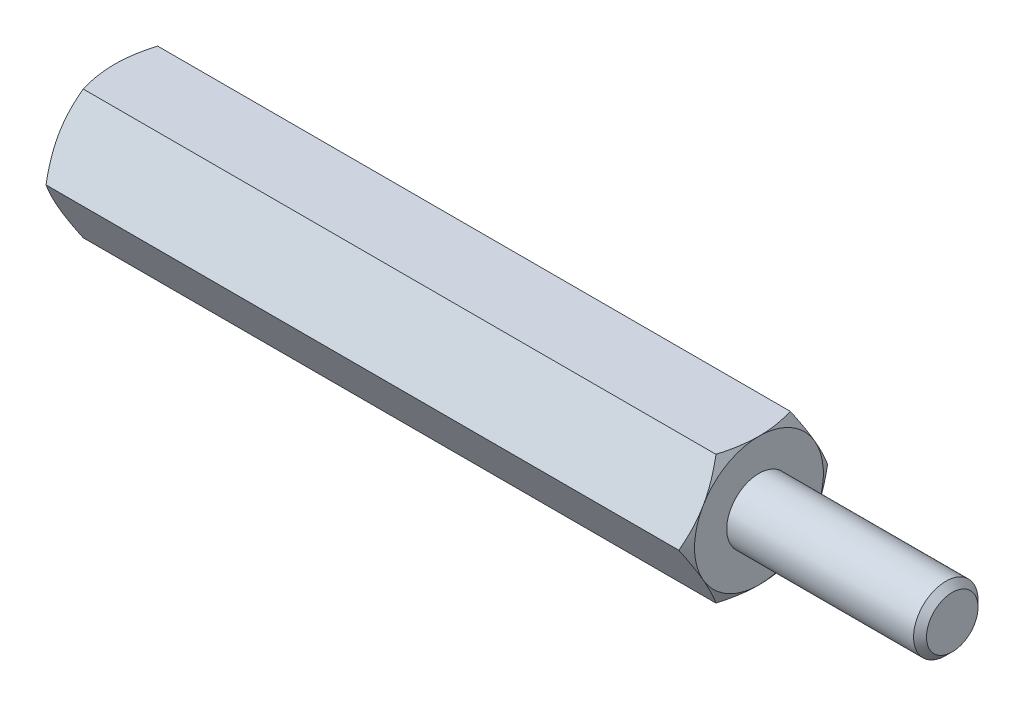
from build123d import *

# Parameters (mm, degrees)
EXTRUDE2_DEPTH = 10
SKETCH3_R      = 0.8
EXTRUDE3_DEPTH = 6
SKETCH5_R      = 1
EXTRUDE4_DEPTH = 6
CHAMFER1_SIZE  = 0.2


with BuildPart() as part:
    # Sketch1 → Extrude2 (new, symmetric)
    with BuildSketch(Plane(origin=(0, 0, 0), x_dir=(0, 0, -1), z_dir=(1, 0, 0))):
        Polygon((1.154700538, 2), (-1.154700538, 2), (-2.309401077, 0), (-1.154700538, -2), (1.154700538, -2), (2.309401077, 0), align=None)
    extrude(amount=EXTRUDE2_DEPTH, both=True)

    # Sketch2 → Cut-Revolve1 (revolve, cut)
    with BuildSketch(Plane.XY):
        with BuildLine():
            Line((-10, 2), (-8.5, 4.598076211))
            ThreePointArc((-8.5, 4.598076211), (-8.98810136, 5.776457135), (-10, 5))
            Line((-10, 5), (-10, 2))
        make_face()
    cut_revolve1 = revolve(axis=Axis((0, 0, 0), (1, 0, 0)), mode=Mode.SUBTRACT)

    # Mirror1: Cut-Revolve1 across plane
    add(cut_revolve1.mirror(Plane(origin=(0, 0, 0), x_dir=(0, 0, 1), z_dir=(1, 0, 0))), mode=Mode.SUBTRACT)

    # Sketch3 → Extrude3 (cut)
    with BuildSketch(Plane.ZY.offset(10)):
        Circle(SKETCH3_R)
    extrude(amount=-EXTRUDE3_DEPTH, mode=Mode.SUBTRACT)

    # Sketch4 → Cut-Revolve2 (revolve, cut)
    with BuildSketch(Plane.XY, mode=Mode.PRIVATE) as cut_revolve2_sk:
        Polygon((-4, 0), (-4, 0.8), (-3.538119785, 0), align=None)
    revolve(cut_revolve2_sk.sketch.rotate(Axis((-3.538119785, 0, 0), (-1, 0, 0)), 270), axis=Axis((-3.538119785, 0, 0), (-1, 0, 0)), mode=Mode.SUBTRACT)

    # Sketch5 → Extrude4 (add)
    with BuildSketch(Plane(origin=(10, 0, 0), x_dir=(0, 0, -1), z_dir=(1, 0, 0))):
        Circle(SKETCH5_R)
    extrude(amount=EXTRUDE4_DEPTH)

    # Chamfer1
    chamfer1_edges = [part.edges().sort_by_distance(p)[0] for p in [
        (16, 0, 1),
    ]]
    chamfer(chamfer1_edges, length=CHAMFER1_SIZE)


solid = part.part
